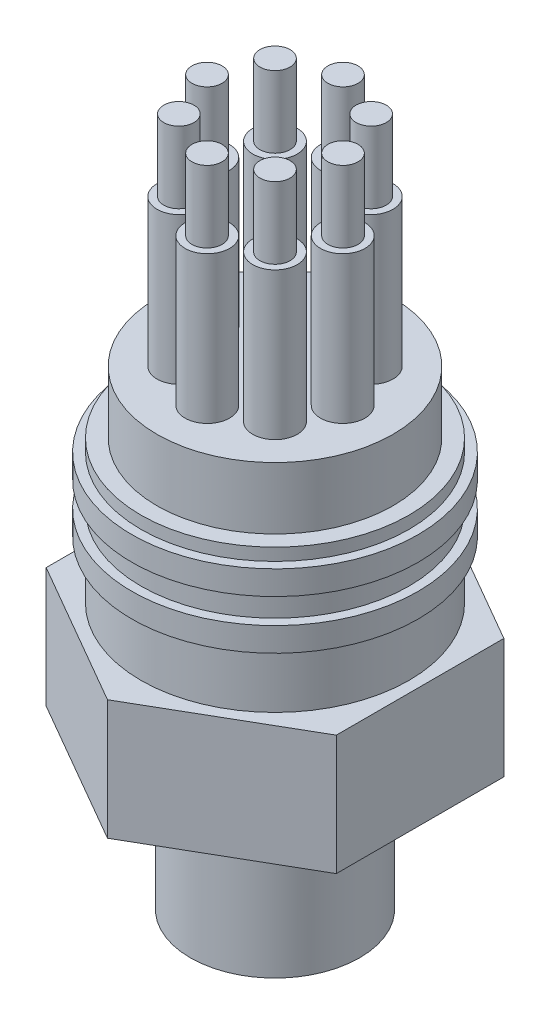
ISO-10303-21;
HEADER;
FILE_DESCRIPTION(('STEP AP214'),'2;1');
FILE_NAME('part.step','',(''),(''),'','','');
FILE_SCHEMA(('AUTOMOTIVE_DESIGN { 1 0 10303 214 1 1 1 1 }'));
ENDSEC;
DATA;
#1=APPLICATION_CONTEXT('core data for automotive mechanical design processes');
#2=APPLICATION_PROTOCOL_DEFINITION('international standard','automotive_design',2000,#1);
#3=PRODUCT_CONTEXT('',#1,'mechanical');
#4=PRODUCT('Part','Part','',(#3));
#5=PRODUCT_RELATED_PRODUCT_CATEGORY('part','',(#4));
#6=PRODUCT_DEFINITION_FORMATION('','',#4);
#7=PRODUCT_DEFINITION_CONTEXT('part definition',#1,'design');
#8=PRODUCT_DEFINITION('design','',#6,#7);
#9=PRODUCT_DEFINITION_SHAPE('','',#8);
#10=(LENGTH_UNIT() NAMED_UNIT(*) SI_UNIT(.MILLI.,.METRE.));
#11=(NAMED_UNIT(*) PLANE_ANGLE_UNIT() SI_UNIT($,.RADIAN.));
#12=(NAMED_UNIT(*) SI_UNIT($,.STERADIAN.) SOLID_ANGLE_UNIT());
#13=UNCERTAINTY_MEASURE_WITH_UNIT(LENGTH_MEASURE(1.E-05),#10,'distance_accuracy_value','');
#14=(GEOMETRIC_REPRESENTATION_CONTEXT(3) GLOBAL_UNCERTAINTY_ASSIGNED_CONTEXT((#13)) GLOBAL_UNIT_ASSIGNED_CONTEXT((#10,
#11,#12)) REPRESENTATION_CONTEXT('',''));
#15=CARTESIAN_POINT('',(0.,0.,0.));
#16=DIRECTION('',(0.,0.,1.));
#17=DIRECTION('',(1.,0.,0.));
#18=AXIS2_PLACEMENT_3D('',#15,#16,#17);
#19=CARTESIAN_POINT('',(0.,-18.280303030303,0.));
#20=DIRECTION('',(0.,1.,0.));
#21=DIRECTION('',(0.,0.,1.));
#22=AXIS2_PLACEMENT_3D('',#19,#20,#21);
#23=CYLINDRICAL_SURFACE('',#22,5.55625);
#24=CARTESIAN_POINT('',(0.,0.,0.));
#25=DIRECTION('',(0.,1.,0.));
#26=DIRECTION('',(0.,0.,1.));
#27=AXIS2_PLACEMENT_3D('',#24,#25,#26);
#28=CIRCLE('',#27,5.55625);
#29=CARTESIAN_POINT('',(0.,0.,5.55625));
#30=VERTEX_POINT('',#29);
#31=EDGE_CURVE('E150',#30,#30,#28,.F.);
#32=ORIENTED_EDGE('',*,*,#31,.T.);
#33=EDGE_LOOP('',(#32));
#34=FACE_BOUND('',#33,.T.);
#35=CARTESIAN_POINT('',(0.,-9.525,0.));
#36=DIRECTION('',(0.,-1.,0.));
#37=DIRECTION('',(0.,0.,-1.));
#38=AXIS2_PLACEMENT_3D('',#35,#36,#37);
#39=CIRCLE('',#38,5.55625);
#40=CARTESIAN_POINT('',(0.,-9.525,-5.55625));
#41=VERTEX_POINT('',#40);
#42=EDGE_CURVE('E40',#41,#41,#39,.T.);
#43=ORIENTED_EDGE('',*,*,#42,.F.);
#44=EDGE_LOOP('',(#43));
#45=FACE_BOUND('',#44,.T.);
#46=ADVANCED_FACE('F36',(#34,#45),#23,.T.);
#47=CARTESIAN_POINT('',(-9.52499999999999,0.,-16.4977839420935));
#48=DIRECTION('',(0.,1.,0.));
#49=DIRECTION('',(0.,0.,1.));
#50=AXIS2_PLACEMENT_3D('',#47,#48,#49);
#51=PLANE('',#50);
#52=DIRECTION('',(-0.866025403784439,0.,-0.5));
#53=VECTOR('',#52,1.);
#54=CARTESIAN_POINT('',(9.52499999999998,0.,-5.4992613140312));
#55=LINE('',#54,#53);
#56=CARTESIAN_POINT('',(9.52499999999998,0.,-5.4992613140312));
#57=VERTEX_POINT('',#56);
#58=CARTESIAN_POINT('',(0.,0.,-10.9985226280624));
#59=VERTEX_POINT('',#58);
#60=EDGE_CURVE('E96',#57,#59,#55,.T.);
#61=ORIENTED_EDGE('',*,*,#60,.F.);
#62=DIRECTION('',(0.,0.,-1.));
#63=VECTOR('',#62,1.);
#64=CARTESIAN_POINT('',(9.52499999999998,0.,5.49926131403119));
#65=LINE('',#64,#63);
#66=CARTESIAN_POINT('',(9.52499999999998,0.,5.49926131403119));
#67=VERTEX_POINT('',#66);
#68=EDGE_CURVE('E126',#67,#57,#65,.T.);
#69=ORIENTED_EDGE('',*,*,#68,.F.);
#70=DIRECTION('',(0.866025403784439,0.,-0.5));
#71=VECTOR('',#70,1.);
#72=CARTESIAN_POINT('',(0.,0.,10.9985226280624));
#73=LINE('',#72,#71);
#74=CARTESIAN_POINT('',(0.,0.,10.9985226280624));
#75=VERTEX_POINT('',#74);
#76=EDGE_CURVE('E124',#75,#67,#73,.T.);
#77=ORIENTED_EDGE('',*,*,#76,.F.);
#78=DIRECTION('',(0.866025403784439,0.,0.5));
#79=VECTOR('',#78,1.);
#80=CARTESIAN_POINT('',(-9.52499999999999,0.,5.49926131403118));
#81=LINE('',#80,#79);
#82=CARTESIAN_POINT('',(-9.52499999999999,0.,5.49926131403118));
#83=VERTEX_POINT('',#82);
#84=EDGE_CURVE('E122',#83,#75,#81,.T.);
#85=ORIENTED_EDGE('',*,*,#84,.F.);
#86=DIRECTION('',(0.,0.,1.));
#87=VECTOR('',#86,1.);
#88=CARTESIAN_POINT('',(-9.52499999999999,0.,-5.49926131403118));
#89=LINE('',#88,#87);
#90=CARTESIAN_POINT('',(-9.52499999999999,0.,-5.49926131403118));
#91=VERTEX_POINT('',#90);
#92=EDGE_CURVE('E98',#91,#83,#89,.T.);
#93=ORIENTED_EDGE('',*,*,#92,.F.);
#94=DIRECTION('',(-0.866025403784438,0.,0.5));
#95=VECTOR('',#94,1.);
#96=CARTESIAN_POINT('',(0.,0.,-10.9985226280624));
#97=LINE('',#96,#95);
#98=EDGE_CURVE('E90',#59,#91,#97,.T.);
#99=ORIENTED_EDGE('',*,*,#98,.F.);
#100=EDGE_LOOP('',(#61,#69,#77,#85,#93,#99));
#101=FACE_BOUND('',#100,.T.);
#102=CARTESIAN_POINT('',(0.,0.,0.));
#103=DIRECTION('',(0.,1.,0.));
#104=DIRECTION('',(0.,0.,1.));
#105=AXIS2_PLACEMENT_3D('',#102,#103,#104);
#106=CIRCLE('',#105,7.94336420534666);
#107=CARTESIAN_POINT('',(0.,0.,7.94336420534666));
#108=VERTEX_POINT('',#107);
#109=EDGE_CURVE('E11',#108,#108,#106,.F.);
#110=ORIENTED_EDGE('',*,*,#109,.F.);
#111=EDGE_LOOP('',(#110));
#112=FACE_BOUND('',#111,.T.);
#113=ADVANCED_FACE('F92',(#101,#112),#51,.F.);
#114=CARTESIAN_POINT('',(-3.14308964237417,30.988,-3.14308964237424));
#115=DIRECTION('',(0.,1.,0.));
#116=DIRECTION('',(-0.707106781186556,0.,0.707106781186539));
#117=AXIS2_PLACEMENT_3D('',#114,#115,#116);
#118=PLANE('',#117);
#119=CARTESIAN_POINT('',(-3.14308964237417,30.988,-3.14308964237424));
#120=DIRECTION('',(0.,1.,0.));
#121=DIRECTION('',(-0.707106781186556,0.,0.707106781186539));
#122=AXIS2_PLACEMENT_3D('',#119,#120,#121);
#123=CIRCLE('',#122,1.4605);
#124=CARTESIAN_POINT('',(-4.17581909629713,30.988,-2.1103601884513));
#125=VERTEX_POINT('',#124);
#126=EDGE_CURVE('E442',#125,#125,#123,.T.);
#127=ORIENTED_EDGE('',*,*,#126,.T.);
#128=EDGE_LOOP('',(#127));
#129=FACE_BOUND('',#128,.T.);
#130=CARTESIAN_POINT('',(-3.15647769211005,30.988,-3.15647769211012));
#131=DIRECTION('',(0.,1.,0.));
#132=DIRECTION('',(-0.707106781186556,0.,0.707106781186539));
#133=AXIS2_PLACEMENT_3D('',#130,#131,#132);
#134=CIRCLE('',#133,0.9906);
#135=CARTESIAN_POINT('',(-3.85693766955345,30.988,-2.45601771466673));
#136=VERTEX_POINT('',#135);
#137=EDGE_CURVE('E487',#136,#136,#134,.T.);
#138=ORIENTED_EDGE('',*,*,#137,.F.);
#139=EDGE_LOOP('',(#138));
#140=FACE_BOUND('',#139,.T.);
#141=ADVANCED_FACE('F176',(#129,#140),#118,.T.);
#142=CARTESIAN_POINT('',(-4.445,30.988,0.));
#143=DIRECTION('',(0.,1.,0.));
#144=DIRECTION('',(0.,0.,1.));
#145=AXIS2_PLACEMENT_3D('',#142,#143,#144);
#146=PLANE('',#145);
#147=CARTESIAN_POINT('',(-4.445,30.988,0.));
#148=DIRECTION('',(0.,1.,0.));
#149=DIRECTION('',(0.,0.,1.));
#150=AXIS2_PLACEMENT_3D('',#147,#148,#149);
#151=CIRCLE('',#150,1.4605);
#152=CARTESIAN_POINT('',(-4.44500000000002,30.988,1.46049999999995));
#153=VERTEX_POINT('',#152);
#154=EDGE_CURVE('E436',#153,#153,#151,.T.);
#155=ORIENTED_EDGE('',*,*,#154,.T.);
#156=EDGE_LOOP('',(#155));
#157=FACE_BOUND('',#156,.T.);
#158=CARTESIAN_POINT('',(-4.46393356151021,30.988,0.));
#159=DIRECTION('',(0.,1.,0.));
#160=DIRECTION('',(0.,0.,1.));
#161=AXIS2_PLACEMENT_3D('',#158,#159,#160);
#162=CIRCLE('',#161,0.9906);
#163=CARTESIAN_POINT('',(-4.46393356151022,30.988,0.990599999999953));
#164=VERTEX_POINT('',#163);
#165=EDGE_CURVE('E481',#164,#164,#162,.T.);
#166=ORIENTED_EDGE('',*,*,#165,.F.);
#167=EDGE_LOOP('',(#166));
#168=FACE_BOUND('',#167,.T.);
#169=ADVANCED_FACE('F242',(#157,#168),#146,.T.);
#170=CARTESIAN_POINT('',(-3.14308964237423,30.988,3.14308964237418));
#171=DIRECTION('',(0.,1.,0.));
#172=DIRECTION('',(0.707106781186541,0.,0.707106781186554));
#173=AXIS2_PLACEMENT_3D('',#170,#171,#172);
#174=PLANE('',#173);
#175=CARTESIAN_POINT('',(-3.14308964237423,30.988,3.14308964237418));
#176=DIRECTION('',(0.,1.,0.));
#177=DIRECTION('',(0.707106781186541,0.,0.707106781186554));
#178=AXIS2_PLACEMENT_3D('',#175,#176,#177);
#179=CIRCLE('',#178,1.4605);
#180=CARTESIAN_POINT('',(-2.11036018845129,30.988,4.17581909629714));
#181=VERTEX_POINT('',#180);
#182=EDGE_CURVE('E430',#181,#181,#179,.T.);
#183=ORIENTED_EDGE('',*,*,#182,.T.);
#184=EDGE_LOOP('',(#183));
#185=FACE_BOUND('',#184,.T.);
#186=CARTESIAN_POINT('',(-3.15647769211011,30.988,3.15647769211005));
#187=DIRECTION('',(0.,1.,0.));
#188=DIRECTION('',(0.707106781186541,0.,0.707106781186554));
#189=AXIS2_PLACEMENT_3D('',#186,#187,#188);
#190=CIRCLE('',#189,0.9906);
#191=CARTESIAN_POINT('',(-2.45601771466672,30.988,3.85693766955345));
#192=VERTEX_POINT('',#191);
#193=EDGE_CURVE('E475',#192,#192,#190,.T.);
#194=ORIENTED_EDGE('',*,*,#193,.F.);
#195=EDGE_LOOP('',(#194));
#196=FACE_BOUND('',#195,.T.);
#197=ADVANCED_FACE('F250',(#185,#196),#174,.T.);
#198=CARTESIAN_POINT('',(0.,30.988,4.445));
#199=DIRECTION('',(0.,1.,0.));
#200=DIRECTION('',(1.,0.,0.));
#201=AXIS2_PLACEMENT_3D('',#198,#199,#200);
#202=PLANE('',#201);
#203=CARTESIAN_POINT('',(0.,30.988,4.445));
#204=DIRECTION('',(0.,1.,0.));
#205=DIRECTION('',(1.,0.,0.));
#206=AXIS2_PLACEMENT_3D('',#203,#204,#205);
#207=CIRCLE('',#206,1.4605);
#208=CARTESIAN_POINT('',(1.46049999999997,30.988,4.44500000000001));
#209=VERTEX_POINT('',#208);
#210=EDGE_CURVE('E424',#209,#209,#207,.T.);
#211=ORIENTED_EDGE('',*,*,#210,.T.);
#212=EDGE_LOOP('',(#211));
#213=FACE_BOUND('',#212,.T.);
#214=CARTESIAN_POINT('',(0.,30.988,4.4639335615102));
#215=DIRECTION('',(0.,1.,0.));
#216=DIRECTION('',(1.,0.,0.));
#217=AXIS2_PLACEMENT_3D('',#214,#215,#216);
#218=CIRCLE('',#217,0.9906);
#219=CARTESIAN_POINT('',(0.990599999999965,30.988,4.46393356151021));
#220=VERTEX_POINT('',#219);
#221=EDGE_CURVE('E469',#220,#220,#218,.T.);
#222=ORIENTED_EDGE('',*,*,#221,.F.);
#223=EDGE_LOOP('',(#222));
#224=FACE_BOUND('',#223,.T.);
#225=ADVANCED_FACE('F258',(#213,#224),#202,.T.);
#226=CARTESIAN_POINT('',(3.14308964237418,30.988,3.14308964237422));
#227=DIRECTION('',(0.,1.,0.));
#228=DIRECTION('',(0.707106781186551,0.,-0.707106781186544));
#229=AXIS2_PLACEMENT_3D('',#226,#227,#228);
#230=PLANE('',#229);
#231=CARTESIAN_POINT('',(3.14308964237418,30.988,3.14308964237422));
#232=DIRECTION('',(0.,1.,0.));
#233=DIRECTION('',(0.707106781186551,0.,-0.707106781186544));
#234=AXIS2_PLACEMENT_3D('',#231,#232,#233);
#235=CIRCLE('',#234,1.4605);
#236=CARTESIAN_POINT('',(4.17581909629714,30.988,2.11036018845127));
#237=VERTEX_POINT('',#236);
#238=EDGE_CURVE('E418',#237,#237,#235,.T.);
#239=ORIENTED_EDGE('',*,*,#238,.T.);
#240=EDGE_LOOP('',(#239));
#241=FACE_BOUND('',#240,.T.);
#242=CARTESIAN_POINT('',(3.15647769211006,30.988,3.1564776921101));
#243=DIRECTION('',(0.,1.,0.));
#244=DIRECTION('',(0.707106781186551,0.,-0.707106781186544));
#245=AXIS2_PLACEMENT_3D('',#242,#243,#244);
#246=CIRCLE('',#245,0.9906);
#247=CARTESIAN_POINT('',(3.85693766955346,30.988,2.45601771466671));
#248=VERTEX_POINT('',#247);
#249=EDGE_CURVE('E463',#248,#248,#246,.T.);
#250=ORIENTED_EDGE('',*,*,#249,.F.);
#251=EDGE_LOOP('',(#250));
#252=FACE_BOUND('',#251,.T.);
#253=ADVANCED_FACE('F266',(#241,#252),#230,.T.);
#254=CARTESIAN_POINT('',(4.445,30.988,0.));
#255=DIRECTION('',(0.,1.,0.));
#256=DIRECTION('',(0.,0.,-1.));
#257=AXIS2_PLACEMENT_3D('',#254,#255,#256);
#258=PLANE('',#257);
#259=CARTESIAN_POINT('',(4.445,30.988,0.));
#260=DIRECTION('',(0.,1.,0.));
#261=DIRECTION('',(0.,0.,-1.));
#262=AXIS2_PLACEMENT_3D('',#259,#260,#261);
#263=CIRCLE('',#262,1.4605);
#264=CARTESIAN_POINT('',(4.445,30.988,-1.46049999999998));
#265=VERTEX_POINT('',#264);
#266=EDGE_CURVE('E412',#265,#265,#263,.T.);
#267=ORIENTED_EDGE('',*,*,#266,.T.);
#268=EDGE_LOOP('',(#267));
#269=FACE_BOUND('',#268,.T.);
#270=CARTESIAN_POINT('',(4.4639335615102,30.988,0.));
#271=DIRECTION('',(0.,1.,0.));
#272=DIRECTION('',(0.,0.,-1.));
#273=AXIS2_PLACEMENT_3D('',#270,#271,#272);
#274=CIRCLE('',#273,0.9906);
#275=CARTESIAN_POINT('',(4.4639335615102,30.988,-0.990599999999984));
#276=VERTEX_POINT('',#275);
#277=EDGE_CURVE('E457',#276,#276,#274,.T.);
#278=ORIENTED_EDGE('',*,*,#277,.F.);
#279=EDGE_LOOP('',(#278));
#280=FACE_BOUND('',#279,.T.);
#281=ADVANCED_FACE('F274',(#269,#280),#258,.T.);
#282=CARTESIAN_POINT('',(3.14308964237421,30.988,-3.1430896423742));
#283=DIRECTION('',(0.,1.,0.));
#284=DIRECTION('',(-0.707106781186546,0.,-0.707106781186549));
#285=AXIS2_PLACEMENT_3D('',#282,#283,#284);
#286=PLANE('',#285);
#287=CARTESIAN_POINT('',(3.14308964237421,30.988,-3.1430896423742));
#288=DIRECTION('',(0.,1.,0.));
#289=DIRECTION('',(-0.707106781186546,0.,-0.707106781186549));
#290=AXIS2_PLACEMENT_3D('',#287,#288,#289);
#291=CIRCLE('',#290,1.4605);
#292=CARTESIAN_POINT('',(2.11036018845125,30.988,-4.17581909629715));
#293=VERTEX_POINT('',#292);
#294=EDGE_CURVE('E408',#293,#293,#291,.T.);
#295=ORIENTED_EDGE('',*,*,#294,.T.);
#296=EDGE_LOOP('',(#295));
#297=FACE_BOUND('',#296,.T.);
#298=CARTESIAN_POINT('',(3.15647769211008,30.988,-3.15647769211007));
#299=DIRECTION('',(0.,1.,0.));
#300=DIRECTION('',(-0.707106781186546,0.,-0.707106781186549));
#301=AXIS2_PLACEMENT_3D('',#298,#299,#300);
#302=CIRCLE('',#301,0.9906);
#303=CARTESIAN_POINT('',(2.45601771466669,30.988,-3.85693766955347));
#304=VERTEX_POINT('',#303);
#305=EDGE_CURVE('E451',#304,#304,#302,.T.);
#306=ORIENTED_EDGE('',*,*,#305,.F.);
#307=EDGE_LOOP('',(#306));
#308=FACE_BOUND('',#307,.T.);
#309=ADVANCED_FACE('F282',(#297,#308),#286,.T.);
#310=CARTESIAN_POINT('',(0.,21.336,0.));
#311=DIRECTION('',(0.,1.,0.));
#312=DIRECTION('',(-1.,0.,0.));
#313=AXIS2_PLACEMENT_3D('',#310,#311,#312);
#314=PLANE('',#313);
#315=CARTESIAN_POINT('',(-4.445,21.336,0.));
#316=DIRECTION('',(0.,1.,0.));
#317=DIRECTION('',(0.,0.,1.));
#318=AXIS2_PLACEMENT_3D('',#315,#316,#317);
#319=CIRCLE('',#318,1.4605);
#320=CARTESIAN_POINT('',(-4.44500000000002,21.336,1.46049999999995));
#321=VERTEX_POINT('',#320);
#322=EDGE_CURVE('E439',#321,#321,#319,.T.);
#323=ORIENTED_EDGE('',*,*,#322,.F.);
#324=EDGE_LOOP('',(#323));
#325=FACE_BOUND('',#324,.T.);
#326=CARTESIAN_POINT('',(0.,21.336,4.445));
#327=DIRECTION('',(0.,1.,0.));
#328=DIRECTION('',(1.,0.,0.));
#329=AXIS2_PLACEMENT_3D('',#326,#327,#328);
#330=CIRCLE('',#329,1.4605);
#331=CARTESIAN_POINT('',(1.46049999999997,21.336,4.44500000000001));
#332=VERTEX_POINT('',#331);
#333=EDGE_CURVE('E427',#332,#332,#330,.T.);
#334=ORIENTED_EDGE('',*,*,#333,.F.);
#335=EDGE_LOOP('',(#334));
#336=FACE_BOUND('',#335,.T.);
#337=CARTESIAN_POINT('',(4.445,21.336,0.));
#338=DIRECTION('',(0.,1.,0.));
#339=DIRECTION('',(0.,0.,-1.));
#340=AXIS2_PLACEMENT_3D('',#337,#338,#339);
#341=CIRCLE('',#340,1.4605);
#342=CARTESIAN_POINT('',(4.445,21.336,-1.46049999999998));
#343=VERTEX_POINT('',#342);
#344=EDGE_CURVE('E415',#343,#343,#341,.T.);
#345=ORIENTED_EDGE('',*,*,#344,.F.);
#346=EDGE_LOOP('',(#345));
#347=FACE_BOUND('',#346,.T.);
#348=CARTESIAN_POINT('',(0.,21.336,-4.445));
#349=DIRECTION('',(0.,1.,0.));
#350=DIRECTION('',(-1.,0.,0.));
#351=AXIS2_PLACEMENT_3D('',#348,#349,#350);
#352=CIRCLE('',#351,1.4605);
#353=CARTESIAN_POINT('',(-1.4605,21.336,-4.445));
#354=VERTEX_POINT('',#353);
#355=EDGE_CURVE('E399',#354,#354,#352,.T.);
#356=ORIENTED_EDGE('',*,*,#355,.F.);
#357=EDGE_LOOP('',(#356));
#358=FACE_BOUND('',#357,.T.);
#359=CARTESIAN_POINT('',(0.,21.336,0.));
#360=DIRECTION('',(0.,1.,0.));
#361=DIRECTION('',(-1.,0.,0.));
#362=AXIS2_PLACEMENT_3D('',#359,#360,#361);
#363=CIRCLE('',#362,7.747);
#364=CARTESIAN_POINT('',(-7.747,21.336,0.));
#365=VERTEX_POINT('',#364);
#366=EDGE_CURVE('E393',#365,#365,#363,.T.);
#367=ORIENTED_EDGE('',*,*,#366,.T.);
#368=EDGE_LOOP('',(#367));
#369=FACE_BOUND('',#368,.T.);
#370=CARTESIAN_POINT('',(3.14308964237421,21.336,-3.1430896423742));
#371=DIRECTION('',(0.,1.,0.));
#372=DIRECTION('',(-0.707106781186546,0.,-0.707106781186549));
#373=AXIS2_PLACEMENT_3D('',#370,#371,#372);
#374=CIRCLE('',#373,1.4605);
#375=CARTESIAN_POINT('',(2.11036018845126,21.336,-4.17581909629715));
#376=VERTEX_POINT('',#375);
#377=EDGE_CURVE('E409',#376,#376,#374,.T.);
#378=ORIENTED_EDGE('',*,*,#377,.F.);
#379=EDGE_LOOP('',(#378));
#380=FACE_BOUND('',#379,.T.);
#381=CARTESIAN_POINT('',(3.14308964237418,21.336,3.14308964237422));
#382=DIRECTION('',(0.,1.,0.));
#383=DIRECTION('',(0.707106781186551,0.,-0.707106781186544));
#384=AXIS2_PLACEMENT_3D('',#381,#382,#383);
#385=CIRCLE('',#384,1.4605);
#386=CARTESIAN_POINT('',(4.17581909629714,21.336,2.11036018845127));
#387=VERTEX_POINT('',#386);
#388=EDGE_CURVE('E421',#387,#387,#385,.T.);
#389=ORIENTED_EDGE('',*,*,#388,.F.);
#390=EDGE_LOOP('',(#389));
#391=FACE_BOUND('',#390,.T.);
#392=CARTESIAN_POINT('',(-3.14308964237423,21.336,3.14308964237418));
#393=DIRECTION('',(0.,1.,0.));
#394=DIRECTION('',(0.707106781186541,0.,0.707106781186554));
#395=AXIS2_PLACEMENT_3D('',#392,#393,#394);
#396=CIRCLE('',#395,1.4605);
#397=CARTESIAN_POINT('',(-2.11036018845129,21.336,4.17581909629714));
#398=VERTEX_POINT('',#397);
#399=EDGE_CURVE('E433',#398,#398,#396,.T.);
#400=ORIENTED_EDGE('',*,*,#399,.F.);
#401=EDGE_LOOP('',(#400));
#402=FACE_BOUND('',#401,.T.);
#403=CARTESIAN_POINT('',(-3.14308964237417,21.336,-3.14308964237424));
#404=DIRECTION('',(0.,1.,0.));
#405=DIRECTION('',(-0.707106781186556,0.,0.707106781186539));
#406=AXIS2_PLACEMENT_3D('',#403,#404,#405);
#407=CIRCLE('',#406,1.4605);
#408=CARTESIAN_POINT('',(-4.17581909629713,21.336,-2.1103601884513));
#409=VERTEX_POINT('',#408);
#410=EDGE_CURVE('E445',#409,#409,#407,.T.);
#411=ORIENTED_EDGE('',*,*,#410,.F.);
#412=EDGE_LOOP('',(#411));
#413=FACE_BOUND('',#412,.T.);
#414=ADVANCED_FACE('F290',(#325,#336,#347,#358,#369,#380,#391,#402,#413),#314,.T.);
#415=CARTESIAN_POINT('',(0.,30.988,-4.445));
#416=DIRECTION('',(0.,1.,0.));
#417=DIRECTION('',(-1.,0.,0.));
#418=AXIS2_PLACEMENT_3D('',#415,#416,#417);
#419=PLANE('',#418);
#420=CARTESIAN_POINT('',(0.,30.988,-4.445));
#421=DIRECTION('',(0.,1.,0.));
#422=DIRECTION('',(-1.,0.,0.));
#423=AXIS2_PLACEMENT_3D('',#420,#421,#422);
#424=CIRCLE('',#423,1.4605);
#425=CARTESIAN_POINT('',(-1.4605,30.988,-4.445));
#426=VERTEX_POINT('',#425);
#427=EDGE_CURVE('E396',#426,#426,#424,.T.);
#428=ORIENTED_EDGE('',*,*,#427,.T.);
#429=EDGE_LOOP('',(#428));
#430=FACE_BOUND('',#429,.T.);
#431=CARTESIAN_POINT('',(0.,30.988,-4.4639335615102));
#432=DIRECTION('',(0.,1.,0.));
#433=DIRECTION('',(-1.,0.,0.));
#434=AXIS2_PLACEMENT_3D('',#431,#432,#433);
#435=CIRCLE('',#434,0.9906);
#436=CARTESIAN_POINT('',(-0.990600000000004,30.988,-4.4639335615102));
#437=VERTEX_POINT('',#436);
#438=EDGE_CURVE('E405',#437,#437,#435,.T.);
#439=ORIENTED_EDGE('',*,*,#438,.F.);
#440=EDGE_LOOP('',(#439));
#441=FACE_BOUND('',#440,.T.);
#442=ADVANCED_FACE('F304',(#430,#441),#419,.T.);
#443=CARTESIAN_POINT('',(8.8011,17.272,0.));
#444=DIRECTION('',(0.,-1.,0.));
#445=DIRECTION('',(1.,0.,0.));
#446=AXIS2_PLACEMENT_3D('',#443,#444,#445);
#447=PLANE('',#446);
#448=CARTESIAN_POINT('',(0.,17.272,0.));
#449=DIRECTION('',(0.,1.,0.));
#450=DIRECTION('',(-1.,0.,0.));
#451=AXIS2_PLACEMENT_3D('',#448,#449,#450);
#452=CIRCLE('',#451,8.8011);
#453=CARTESIAN_POINT('',(-8.8011,17.272,0.));
#454=VERTEX_POINT('',#453);
#455=EDGE_CURVE('E114',#454,#454,#452,.T.);
#456=ORIENTED_EDGE('',*,*,#455,.T.);
#457=EDGE_LOOP('',(#456));
#458=FACE_BOUND('',#457,.T.);
#459=CARTESIAN_POINT('',(0.,17.272,0.));
#460=DIRECTION('',(0.,-1.,0.));
#461=DIRECTION('',(1.,0.,0.));
#462=AXIS2_PLACEMENT_3D('',#459,#460,#461);
#463=CIRCLE('',#462,7.747);
#464=CARTESIAN_POINT('',(7.747,17.272,0.));
#465=VERTEX_POINT('',#464);
#466=EDGE_CURVE('E109',#465,#465,#463,.F.);
#467=ORIENTED_EDGE('',*,*,#466,.F.);
#468=EDGE_LOOP('',(#467));
#469=FACE_BOUND('',#468,.T.);
#470=ADVANCED_FACE('F307',(#458,#469),#447,.F.);
#471=CARTESIAN_POINT('',(-9.52499999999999,7.874,-16.4977839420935));
#472=DIRECTION('',(0.,1.,0.));
#473=DIRECTION('',(0.,0.,1.));
#474=AXIS2_PLACEMENT_3D('',#471,#472,#473);
#475=PLANE('',#474);
#476=DIRECTION('',(-0.866025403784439,0.,-0.5));
#477=VECTOR('',#476,1.);
#478=CARTESIAN_POINT('',(9.52499999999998,7.874,-5.4992613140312));
#479=LINE('',#478,#477);
#480=CARTESIAN_POINT('',(9.52499999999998,7.874,-5.4992613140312));
#481=VERTEX_POINT('',#480);
#482=CARTESIAN_POINT('',(0.,7.874,-10.9985226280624));
#483=VERTEX_POINT('',#482);
#484=EDGE_CURVE('E128',#481,#483,#479,.T.);
#485=ORIENTED_EDGE('',*,*,#484,.T.);
#486=DIRECTION('',(-0.866025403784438,0.,0.5));
#487=VECTOR('',#486,1.);
#488=CARTESIAN_POINT('',(0.,7.874,-10.9985226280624));
#489=LINE('',#488,#487);
#490=CARTESIAN_POINT('',(-9.52499999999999,7.874,-5.49926131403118));
#491=VERTEX_POINT('',#490);
#492=EDGE_CURVE('E106',#483,#491,#489,.T.);
#493=ORIENTED_EDGE('',*,*,#492,.T.);
#494=DIRECTION('',(0.,0.,1.));
#495=VECTOR('',#494,1.);
#496=CARTESIAN_POINT('',(-9.52499999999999,7.874,-5.49926131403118));
#497=LINE('',#496,#495);
#498=CARTESIAN_POINT('',(-9.52499999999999,7.874,5.49926131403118));
#499=VERTEX_POINT('',#498);
#500=EDGE_CURVE('E131',#491,#499,#497,.T.);
#501=ORIENTED_EDGE('',*,*,#500,.T.);
#502=DIRECTION('',(0.866025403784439,0.,0.5));
#503=VECTOR('',#502,1.);
#504=CARTESIAN_POINT('',(-9.52499999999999,7.874,5.49926131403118));
#505=LINE('',#504,#503);
#506=CARTESIAN_POINT('',(0.,7.874,10.9985226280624));
#507=VERTEX_POINT('',#506);
#508=EDGE_CURVE('E133',#499,#507,#505,.T.);
#509=ORIENTED_EDGE('',*,*,#508,.T.);
#510=DIRECTION('',(0.866025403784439,0.,-0.5));
#511=VECTOR('',#510,1.);
#512=CARTESIAN_POINT('',(0.,7.874,10.9985226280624));
#513=LINE('',#512,#511);
#514=CARTESIAN_POINT('',(9.52499999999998,7.874,5.49926131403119));
#515=VERTEX_POINT('',#514);
#516=EDGE_CURVE('E57',#507,#515,#513,.T.);
#517=ORIENTED_EDGE('',*,*,#516,.T.);
#518=DIRECTION('',(0.,0.,-1.));
#519=VECTOR('',#518,1.);
#520=CARTESIAN_POINT('',(9.52499999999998,7.874,5.49926131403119));
#521=LINE('',#520,#519);
#522=EDGE_CURVE('E52',#515,#481,#521,.T.);
#523=ORIENTED_EDGE('',*,*,#522,.T.);
#524=EDGE_LOOP('',(#485,#493,#501,#509,#517,#523));
#525=FACE_BOUND('',#524,.T.);
#526=CARTESIAN_POINT('',(0.,7.874,0.));
#527=DIRECTION('',(0.,1.,0.));
#528=DIRECTION('',(-1.,0.,0.));
#529=AXIS2_PLACEMENT_3D('',#526,#527,#528);
#530=CIRCLE('',#529,8.8011);
#531=CARTESIAN_POINT('',(-8.8011,7.874,0.));
#532=VERTEX_POINT('',#531);
#533=EDGE_CURVE('E390',#532,#532,#530,.T.);
#534=ORIENTED_EDGE('',*,*,#533,.F.);
#535=EDGE_LOOP('',(#534));
#536=FACE_BOUND('',#535,.T.);
#537=ADVANCED_FACE('F356',(#525,#536),#475,.T.);
#538=CARTESIAN_POINT('',(9.52499999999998,7.874,-5.4992613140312));
#539=DIRECTION('',(-0.5,0.,0.866025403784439));
#540=DIRECTION('',(0.866025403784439,0.,0.5));
#541=AXIS2_PLACEMENT_3D('',#538,#539,#540);
#542=PLANE('',#541);
#543=ORIENTED_EDGE('',*,*,#60,.T.);
#544=DIRECTION('',(0.,-1.,0.));
#545=VECTOR('',#544,1.);
#546=CARTESIAN_POINT('',(0.,7.874,-10.9985226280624));
#547=LINE('',#546,#545);
#548=EDGE_CURVE('E104',#483,#59,#547,.T.);
#549=ORIENTED_EDGE('',*,*,#548,.F.);
#550=ORIENTED_EDGE('',*,*,#484,.F.);
#551=DIRECTION('',(0.,-1.,0.));
#552=VECTOR('',#551,1.);
#553=CARTESIAN_POINT('',(9.52499999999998,7.874,-5.4992613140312));
#554=LINE('',#553,#552);
#555=EDGE_CURVE('E113',#481,#57,#554,.T.);
#556=ORIENTED_EDGE('',*,*,#555,.T.);
#557=EDGE_LOOP('',(#543,#549,#550,#556));
#558=FACE_BOUND('',#557,.T.);
#559=ADVANCED_FACE('F38',(#558),#542,.F.);
#560=CARTESIAN_POINT('',(0.,7.874,-10.9985226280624));
#561=DIRECTION('',(0.5,0.,0.866025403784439));
#562=DIRECTION('',(0.866025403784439,0.,-0.5));
#563=AXIS2_PLACEMENT_3D('',#560,#561,#562);
#564=PLANE('',#563);
#565=ORIENTED_EDGE('',*,*,#98,.T.);
#566=DIRECTION('',(0.,-1.,0.));
#567=VECTOR('',#566,1.);
#568=CARTESIAN_POINT('',(-9.52499999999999,7.874,-5.49926131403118));
#569=LINE('',#568,#567);
#570=EDGE_CURVE('E110',#491,#91,#569,.T.);
#571=ORIENTED_EDGE('',*,*,#570,.F.);
#572=ORIENTED_EDGE('',*,*,#492,.F.);
#573=ORIENTED_EDGE('',*,*,#548,.T.);
#574=EDGE_LOOP('',(#565,#571,#572,#573));
#575=FACE_BOUND('',#574,.T.);
#576=ADVANCED_FACE('F105',(#575),#564,.F.);
#577=CARTESIAN_POINT('',(-9.52499999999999,7.874,-5.49926131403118));
#578=DIRECTION('',(1.,0.,0.));
#579=DIRECTION('',(0.,0.,-1.));
#580=AXIS2_PLACEMENT_3D('',#577,#578,#579);
#581=PLANE('',#580);
#582=ORIENTED_EDGE('',*,*,#92,.T.);
#583=DIRECTION('',(0.,-1.,0.));
#584=VECTOR('',#583,1.);
#585=CARTESIAN_POINT('',(-9.52499999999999,7.874,5.49926131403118));
#586=LINE('',#585,#584);
#587=EDGE_CURVE('E144',#499,#83,#586,.T.);
#588=ORIENTED_EDGE('',*,*,#587,.F.);
#589=ORIENTED_EDGE('',*,*,#500,.F.);
#590=ORIENTED_EDGE('',*,*,#570,.T.);
#591=EDGE_LOOP('',(#582,#588,#589,#590));
#592=FACE_BOUND('',#591,.T.);
#593=ADVANCED_FACE('F589',(#592),#581,.F.);
#594=CARTESIAN_POINT('',(-9.52499999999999,7.874,5.49926131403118));
#595=DIRECTION('',(0.5,0.,-0.866025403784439));
#596=DIRECTION('',(-0.866025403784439,0.,-0.5));
#597=AXIS2_PLACEMENT_3D('',#594,#595,#596);
#598=PLANE('',#597);
#599=ORIENTED_EDGE('',*,*,#84,.T.);
#600=DIRECTION('',(0.,-1.,0.));
#601=VECTOR('',#600,1.);
#602=CARTESIAN_POINT('',(0.,7.874,10.9985226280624));
#603=LINE('',#602,#601);
#604=EDGE_CURVE('E141',#507,#75,#603,.T.);
#605=ORIENTED_EDGE('',*,*,#604,.F.);
#606=ORIENTED_EDGE('',*,*,#508,.F.);
#607=ORIENTED_EDGE('',*,*,#587,.T.);
#608=EDGE_LOOP('',(#599,#605,#606,#607));
#609=FACE_BOUND('',#608,.T.);
#610=ADVANCED_FACE('F585',(#609),#598,.F.);
#611=CARTESIAN_POINT('',(0.,7.874,10.9985226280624));
#612=DIRECTION('',(-0.5,0.,-0.866025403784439));
#613=DIRECTION('',(-0.866025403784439,0.,0.5));
#614=AXIS2_PLACEMENT_3D('',#611,#612,#613);
#615=PLANE('',#614);
#616=ORIENTED_EDGE('',*,*,#76,.T.);
#617=DIRECTION('',(0.,-1.,0.));
#618=VECTOR('',#617,1.);
#619=CARTESIAN_POINT('',(9.52499999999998,7.874,5.49926131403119));
#620=LINE('',#619,#618);
#621=EDGE_CURVE('E138',#515,#67,#620,.T.);
#622=ORIENTED_EDGE('',*,*,#621,.F.);
#623=ORIENTED_EDGE('',*,*,#516,.F.);
#624=ORIENTED_EDGE('',*,*,#604,.T.);
#625=EDGE_LOOP('',(#616,#622,#623,#624));
#626=FACE_BOUND('',#625,.T.);
#627=ADVANCED_FACE('F581',(#626),#615,.F.);
#628=CARTESIAN_POINT('',(9.52499999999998,7.874,5.49926131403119));
#629=DIRECTION('',(-1.,0.,0.));
#630=DIRECTION('',(0.,0.,1.));
#631=AXIS2_PLACEMENT_3D('',#628,#629,#630);
#632=PLANE('',#631);
#633=ORIENTED_EDGE('',*,*,#68,.T.);
#634=ORIENTED_EDGE('',*,*,#555,.F.);
#635=ORIENTED_EDGE('',*,*,#522,.F.);
#636=ORIENTED_EDGE('',*,*,#621,.T.);
#637=EDGE_LOOP('',(#633,#634,#635,#636));
#638=FACE_BOUND('',#637,.T.);
#639=ADVANCED_FACE('F353',(#638),#632,.F.);
#640=CARTESIAN_POINT('',(0.,0.,0.));
#641=DIRECTION('',(0.,1.,0.));
#642=DIRECTION('',(-1.,0.,0.));
#643=AXIS2_PLACEMENT_3D('',#640,#641,#642);
#644=CYLINDRICAL_SURFACE('',#643,8.8011);
#645=ORIENTED_EDGE('',*,*,#455,.F.);
#646=EDGE_LOOP('',(#645));
#647=FACE_BOUND('',#646,.T.);
#648=CARTESIAN_POINT('',(0.,16.4592,0.));
#649=DIRECTION('',(0.,1.,0.));
#650=DIRECTION('',(-1.,0.,0.));
#651=AXIS2_PLACEMENT_3D('',#648,#649,#650);
#652=CIRCLE('',#651,8.8011);
#653=CARTESIAN_POINT('',(-8.8011,16.4592,0.));
#654=VERTEX_POINT('',#653);
#655=EDGE_CURVE('E117',#654,#654,#652,.T.);
#656=ORIENTED_EDGE('',*,*,#655,.T.);
#657=EDGE_LOOP('',(#656));
#658=FACE_BOUND('',#657,.T.);
#659=ADVANCED_FACE('F350',(#647,#658),#644,.T.);
#660=CARTESIAN_POINT('',(9.398,16.4592,0.));
#661=DIRECTION('',(0.,-1.,0.));
#662=DIRECTION('',(1.,0.,0.));
#663=AXIS2_PLACEMENT_3D('',#660,#661,#662);
#664=PLANE('',#663);
#665=ORIENTED_EDGE('',*,*,#655,.F.);
#666=EDGE_LOOP('',(#665));
#667=FACE_BOUND('',#666,.T.);
#668=CARTESIAN_POINT('',(0.,16.4592,0.));
#669=DIRECTION('',(0.,1.,0.));
#670=DIRECTION('',(-1.,0.,0.));
#671=AXIS2_PLACEMENT_3D('',#668,#669,#670);
#672=CIRCLE('',#671,9.398);
#673=CARTESIAN_POINT('',(-9.398,16.4592,0.));
#674=VERTEX_POINT('',#673);
#675=EDGE_CURVE('E368',#674,#674,#672,.T.);
#676=ORIENTED_EDGE('',*,*,#675,.T.);
#677=EDGE_LOOP('',(#676));
#678=FACE_BOUND('',#677,.T.);
#679=ADVANCED_FACE('F346',(#667,#678),#664,.F.);
#680=CARTESIAN_POINT('',(0.,0.,0.));
#681=DIRECTION('',(0.,1.,0.));
#682=DIRECTION('',(-1.,0.,0.));
#683=AXIS2_PLACEMENT_3D('',#680,#681,#682);
#684=CYLINDRICAL_SURFACE('',#683,9.398);
#685=ORIENTED_EDGE('',*,*,#675,.F.);
#686=EDGE_LOOP('',(#685));
#687=FACE_BOUND('',#686,.T.);
#688=CARTESIAN_POINT('',(0.,14.8844,0.));
#689=DIRECTION('',(0.,1.,0.));
#690=DIRECTION('',(-1.,0.,0.));
#691=AXIS2_PLACEMENT_3D('',#688,#689,#690);
#692=CIRCLE('',#691,9.398);
#693=CARTESIAN_POINT('',(-9.398,14.8844,0.));
#694=VERTEX_POINT('',#693);
#695=EDGE_CURVE('E370',#694,#694,#692,.T.);
#696=ORIENTED_EDGE('',*,*,#695,.T.);
#697=EDGE_LOOP('',(#696));
#698=FACE_BOUND('',#697,.T.);
#699=ADVANCED_FACE('F342',(#687,#698),#684,.T.);
#700=CARTESIAN_POINT('',(8.8011,14.8844,0.));
#701=DIRECTION('',(0.,1.,0.));
#702=DIRECTION('',(-1.,0.,0.));
#703=AXIS2_PLACEMENT_3D('',#700,#701,#702);
#704=PLANE('',#703);
#705=ORIENTED_EDGE('',*,*,#695,.F.);
#706=EDGE_LOOP('',(#705));
#707=FACE_BOUND('',#706,.T.);
#708=CARTESIAN_POINT('',(0.,14.8844,0.));
#709=DIRECTION('',(0.,1.,0.));
#710=DIRECTION('',(-1.,0.,0.));
#711=AXIS2_PLACEMENT_3D('',#708,#709,#710);
#712=CIRCLE('',#711,8.8011);
#713=CARTESIAN_POINT('',(-8.8011,14.8844,0.));
#714=VERTEX_POINT('',#713);
#715=EDGE_CURVE('E375',#714,#714,#712,.T.);
#716=ORIENTED_EDGE('',*,*,#715,.T.);
#717=EDGE_LOOP('',(#716));
#718=FACE_BOUND('',#717,.T.);
#719=ADVANCED_FACE('F338',(#707,#718),#704,.F.);
#720=CARTESIAN_POINT('',(0.,0.,0.));
#721=DIRECTION('',(0.,1.,0.));
#722=DIRECTION('',(-1.,0.,0.));
#723=AXIS2_PLACEMENT_3D('',#720,#721,#722);
#724=CYLINDRICAL_SURFACE('',#723,8.8011);
#725=ORIENTED_EDGE('',*,*,#715,.F.);
#726=EDGE_LOOP('',(#725));
#727=FACE_BOUND('',#726,.T.);
#728=CARTESIAN_POINT('',(0.,13.2334,0.));
#729=DIRECTION('',(0.,1.,0.));
#730=DIRECTION('',(-1.,0.,0.));
#731=AXIS2_PLACEMENT_3D('',#728,#729,#730);
#732=CIRCLE('',#731,8.8011);
#733=CARTESIAN_POINT('',(-8.8011,13.2334,0.));
#734=VERTEX_POINT('',#733);
#735=EDGE_CURVE('E378',#734,#734,#732,.T.);
#736=ORIENTED_EDGE('',*,*,#735,.T.);
#737=EDGE_LOOP('',(#736));
#738=FACE_BOUND('',#737,.T.);
#739=ADVANCED_FACE('F334',(#727,#738),#724,.T.);
#740=CARTESIAN_POINT('',(9.398,13.2334,0.));
#741=DIRECTION('',(0.,-1.,0.));
#742=DIRECTION('',(1.,0.,0.));
#743=AXIS2_PLACEMENT_3D('',#740,#741,#742);
#744=PLANE('',#743);
#745=ORIENTED_EDGE('',*,*,#735,.F.);
#746=EDGE_LOOP('',(#745));
#747=FACE_BOUND('',#746,.T.);
#748=CARTESIAN_POINT('',(0.,13.2334,0.));
#749=DIRECTION('',(0.,1.,0.));
#750=DIRECTION('',(-1.,0.,0.));
#751=AXIS2_PLACEMENT_3D('',#748,#749,#750);
#752=CIRCLE('',#751,9.398);
#753=CARTESIAN_POINT('',(-9.398,13.2334,0.));
#754=VERTEX_POINT('',#753);
#755=EDGE_CURVE('E381',#754,#754,#752,.T.);
#756=ORIENTED_EDGE('',*,*,#755,.T.);
#757=EDGE_LOOP('',(#756));
#758=FACE_BOUND('',#757,.T.);
#759=ADVANCED_FACE('F330',(#747,#758),#744,.F.);
#760=CARTESIAN_POINT('',(0.,0.,0.));
#761=DIRECTION('',(0.,1.,0.));
#762=DIRECTION('',(-1.,0.,0.));
#763=AXIS2_PLACEMENT_3D('',#760,#761,#762);
#764=CYLINDRICAL_SURFACE('',#763,9.398);
#765=ORIENTED_EDGE('',*,*,#755,.F.);
#766=EDGE_LOOP('',(#765));
#767=FACE_BOUND('',#766,.T.);
#768=CARTESIAN_POINT('',(0.,11.6586,0.));
#769=DIRECTION('',(0.,1.,0.));
#770=DIRECTION('',(-1.,0.,0.));
#771=AXIS2_PLACEMENT_3D('',#768,#769,#770);
#772=CIRCLE('',#771,9.398);
#773=CARTESIAN_POINT('',(-9.398,11.6586,0.));
#774=VERTEX_POINT('',#773);
#775=EDGE_CURVE('E384',#774,#774,#772,.T.);
#776=ORIENTED_EDGE('',*,*,#775,.T.);
#777=EDGE_LOOP('',(#776));
#778=FACE_BOUND('',#777,.T.);
#779=ADVANCED_FACE('F326',(#767,#778),#764,.T.);
#780=CARTESIAN_POINT('',(8.80109999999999,11.6586,0.));
#781=DIRECTION('',(0.,1.,0.));
#782=DIRECTION('',(-1.,0.,0.));
#783=AXIS2_PLACEMENT_3D('',#780,#781,#782);
#784=PLANE('',#783);
#785=ORIENTED_EDGE('',*,*,#775,.F.);
#786=EDGE_LOOP('',(#785));
#787=FACE_BOUND('',#786,.T.);
#788=CARTESIAN_POINT('',(0.,11.6586,0.));
#789=DIRECTION('',(0.,1.,0.));
#790=DIRECTION('',(-1.,0.,0.));
#791=AXIS2_PLACEMENT_3D('',#788,#789,#790);
#792=CIRCLE('',#791,8.8011);
#793=CARTESIAN_POINT('',(-8.8011,11.6586,0.));
#794=VERTEX_POINT('',#793);
#795=EDGE_CURVE('E387',#794,#794,#792,.T.);
#796=ORIENTED_EDGE('',*,*,#795,.T.);
#797=EDGE_LOOP('',(#796));
#798=FACE_BOUND('',#797,.T.);
#799=ADVANCED_FACE('F322',(#787,#798),#784,.F.);
#800=CARTESIAN_POINT('',(0.,0.,0.));
#801=DIRECTION('',(0.,1.,0.));
#802=DIRECTION('',(-1.,0.,0.));
#803=AXIS2_PLACEMENT_3D('',#800,#801,#802);
#804=CYLINDRICAL_SURFACE('',#803,8.8011);
#805=ORIENTED_EDGE('',*,*,#795,.F.);
#806=EDGE_LOOP('',(#805));
#807=FACE_BOUND('',#806,.T.);
#808=ORIENTED_EDGE('',*,*,#533,.T.);
#809=EDGE_LOOP('',(#808));
#810=FACE_BOUND('',#809,.T.);
#811=ADVANCED_FACE('F318',(#807,#810),#804,.T.);
#812=CARTESIAN_POINT('',(0.,21.336,0.));
#813=DIRECTION('',(0.,-1.,0.));
#814=DIRECTION('',(1.,0.,0.));
#815=AXIS2_PLACEMENT_3D('',#812,#813,#814);
#816=CYLINDRICAL_SURFACE('',#815,7.747);
#817=ORIENTED_EDGE('',*,*,#366,.F.);
#818=EDGE_LOOP('',(#817));
#819=FACE_BOUND('',#818,.T.);
#820=ORIENTED_EDGE('',*,*,#466,.T.);
#821=EDGE_LOOP('',(#820));
#822=FACE_BOUND('',#821,.T.);
#823=ADVANCED_FACE('F311',(#819,#822),#816,.T.);
#824=CARTESIAN_POINT('',(0.,30.988,-4.445));
#825=DIRECTION('',(0.,-1.,0.));
#826=DIRECTION('',(1.,0.,0.));
#827=AXIS2_PLACEMENT_3D('',#824,#825,#826);
#828=CYLINDRICAL_SURFACE('',#827,1.4605);
#829=ORIENTED_EDGE('',*,*,#427,.F.);
#830=EDGE_LOOP('',(#829));
#831=FACE_BOUND('',#830,.T.);
#832=ORIENTED_EDGE('',*,*,#355,.T.);
#833=EDGE_LOOP('',(#832));
#834=FACE_BOUND('',#833,.T.);
#835=ADVANCED_FACE('F302',(#831,#834),#828,.T.);
#836=CARTESIAN_POINT('',(0.,35.687,-4.4639335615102));
#837=DIRECTION('',(0.,-1.,0.));
#838=DIRECTION('',(1.,0.,0.));
#839=AXIS2_PLACEMENT_3D('',#836,#837,#838);
#840=CYLINDRICAL_SURFACE('',#839,0.9906);
#841=CARTESIAN_POINT('',(0.,35.687,-4.4639335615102));
#842=DIRECTION('',(0.,1.,0.));
#843=DIRECTION('',(-1.,0.,0.));
#844=AXIS2_PLACEMENT_3D('',#841,#842,#843);
#845=CIRCLE('',#844,0.9906);
#846=CARTESIAN_POINT('',(-0.990600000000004,35.687,-4.4639335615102));
#847=VERTEX_POINT('',#846);
#848=EDGE_CURVE('E402',#847,#847,#845,.T.);
#849=ORIENTED_EDGE('',*,*,#848,.F.);
#850=EDGE_LOOP('',(#849));
#851=FACE_BOUND('',#850,.T.);
#852=ORIENTED_EDGE('',*,*,#438,.T.);
#853=EDGE_LOOP('',(#852));
#854=FACE_BOUND('',#853,.T.);
#855=ADVANCED_FACE('F298',(#851,#854),#840,.T.);
#856=CARTESIAN_POINT('',(0.,35.687,-4.4639335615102));
#857=DIRECTION('',(0.,1.,0.));
#858=DIRECTION('',(-1.,0.,0.));
#859=AXIS2_PLACEMENT_3D('',#856,#857,#858);
#860=PLANE('',#859);
#861=ORIENTED_EDGE('',*,*,#848,.T.);
#862=EDGE_LOOP('',(#861));
#863=FACE_BOUND('',#862,.T.);
#864=ADVANCED_FACE('F294',(#863),#860,.T.);
#865=CARTESIAN_POINT('',(3.14308964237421,30.988,-3.1430896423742));
#866=DIRECTION('',(0.,-1.,0.));
#867=DIRECTION('',(1.,0.,0.));
#868=AXIS2_PLACEMENT_3D('',#865,#866,#867);
#869=CYLINDRICAL_SURFACE('',#868,1.4605);
#870=ORIENTED_EDGE('',*,*,#294,.F.);
#871=EDGE_LOOP('',(#870));
#872=FACE_BOUND('',#871,.T.);
#873=ORIENTED_EDGE('',*,*,#377,.T.);
#874=EDGE_LOOP('',(#873));
#875=FACE_BOUND('',#874,.T.);
#876=ADVANCED_FACE('F286',(#872,#875),#869,.T.);
#877=CARTESIAN_POINT('',(4.445,30.988,0.));
#878=DIRECTION('',(0.,-1.,0.));
#879=DIRECTION('',(1.,0.,0.));
#880=AXIS2_PLACEMENT_3D('',#877,#878,#879);
#881=CYLINDRICAL_SURFACE('',#880,1.4605);
#882=ORIENTED_EDGE('',*,*,#266,.F.);
#883=EDGE_LOOP('',(#882));
#884=FACE_BOUND('',#883,.T.);
#885=ORIENTED_EDGE('',*,*,#344,.T.);
#886=EDGE_LOOP('',(#885));
#887=FACE_BOUND('',#886,.T.);
#888=ADVANCED_FACE('F278',(#884,#887),#881,.T.);
#889=CARTESIAN_POINT('',(3.14308964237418,30.988,3.14308964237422));
#890=DIRECTION('',(0.,-1.,0.));
#891=DIRECTION('',(1.,0.,0.));
#892=AXIS2_PLACEMENT_3D('',#889,#890,#891);
#893=CYLINDRICAL_SURFACE('',#892,1.4605);
#894=ORIENTED_EDGE('',*,*,#238,.F.);
#895=EDGE_LOOP('',(#894));
#896=FACE_BOUND('',#895,.T.);
#897=ORIENTED_EDGE('',*,*,#388,.T.);
#898=EDGE_LOOP('',(#897));
#899=FACE_BOUND('',#898,.T.);
#900=ADVANCED_FACE('F270',(#896,#899),#893,.T.);
#901=CARTESIAN_POINT('',(0.,30.988,4.445));
#902=DIRECTION('',(0.,-1.,0.));
#903=DIRECTION('',(1.,0.,0.));
#904=AXIS2_PLACEMENT_3D('',#901,#902,#903);
#905=CYLINDRICAL_SURFACE('',#904,1.4605);
#906=ORIENTED_EDGE('',*,*,#210,.F.);
#907=EDGE_LOOP('',(#906));
#908=FACE_BOUND('',#907,.T.);
#909=ORIENTED_EDGE('',*,*,#333,.T.);
#910=EDGE_LOOP('',(#909));
#911=FACE_BOUND('',#910,.T.);
#912=ADVANCED_FACE('F262',(#908,#911),#905,.T.);
#913=CARTESIAN_POINT('',(-3.14308964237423,30.988,3.14308964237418));
#914=DIRECTION('',(0.,-1.,0.));
#915=DIRECTION('',(1.,0.,0.));
#916=AXIS2_PLACEMENT_3D('',#913,#914,#915);
#917=CYLINDRICAL_SURFACE('',#916,1.4605);
#918=ORIENTED_EDGE('',*,*,#182,.F.);
#919=EDGE_LOOP('',(#918));
#920=FACE_BOUND('',#919,.T.);
#921=ORIENTED_EDGE('',*,*,#399,.T.);
#922=EDGE_LOOP('',(#921));
#923=FACE_BOUND('',#922,.T.);
#924=ADVANCED_FACE('F254',(#920,#923),#917,.T.);
#925=CARTESIAN_POINT('',(-4.445,30.988,0.));
#926=DIRECTION('',(0.,-1.,0.));
#927=DIRECTION('',(1.,0.,0.));
#928=AXIS2_PLACEMENT_3D('',#925,#926,#927);
#929=CYLINDRICAL_SURFACE('',#928,1.4605);
#930=ORIENTED_EDGE('',*,*,#154,.F.);
#931=EDGE_LOOP('',(#930));
#932=FACE_BOUND('',#931,.T.);
#933=ORIENTED_EDGE('',*,*,#322,.T.);
#934=EDGE_LOOP('',(#933));
#935=FACE_BOUND('',#934,.T.);
#936=ADVANCED_FACE('F246',(#932,#935),#929,.T.);
#937=CARTESIAN_POINT('',(-3.14308964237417,30.988,-3.14308964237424));
#938=DIRECTION('',(0.,-1.,0.));
#939=DIRECTION('',(1.,0.,0.));
#940=AXIS2_PLACEMENT_3D('',#937,#938,#939);
#941=CYLINDRICAL_SURFACE('',#940,1.4605);
#942=ORIENTED_EDGE('',*,*,#126,.F.);
#943=EDGE_LOOP('',(#942));
#944=FACE_BOUND('',#943,.T.);
#945=ORIENTED_EDGE('',*,*,#410,.T.);
#946=EDGE_LOOP('',(#945));
#947=FACE_BOUND('',#946,.T.);
#948=ADVANCED_FACE('F238',(#944,#947),#941,.T.);
#949=CARTESIAN_POINT('',(3.15647769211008,35.687,-3.15647769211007));
#950=DIRECTION('',(0.,-1.,0.));
#951=DIRECTION('',(1.,0.,0.));
#952=AXIS2_PLACEMENT_3D('',#949,#950,#951);
#953=CYLINDRICAL_SURFACE('',#952,0.9906);
#954=CARTESIAN_POINT('',(3.15647769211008,35.687,-3.15647769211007));
#955=DIRECTION('',(0.,1.,0.));
#956=DIRECTION('',(-0.707106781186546,0.,-0.707106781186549));
#957=AXIS2_PLACEMENT_3D('',#954,#955,#956);
#958=CIRCLE('',#957,0.9906);
#959=CARTESIAN_POINT('',(2.45601771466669,35.687,-3.85693766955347));
#960=VERTEX_POINT('',#959);
#961=EDGE_CURVE('E448',#960,#960,#958,.T.);
#962=ORIENTED_EDGE('',*,*,#961,.F.);
#963=EDGE_LOOP('',(#962));
#964=FACE_BOUND('',#963,.T.);
#965=ORIENTED_EDGE('',*,*,#305,.T.);
#966=EDGE_LOOP('',(#965));
#967=FACE_BOUND('',#966,.T.);
#968=ADVANCED_FACE('F234',(#964,#967),#953,.T.);
#969=CARTESIAN_POINT('',(3.15647769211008,35.687,-3.15647769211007));
#970=DIRECTION('',(0.,1.,0.));
#971=DIRECTION('',(-0.707106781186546,0.,-0.707106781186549));
#972=AXIS2_PLACEMENT_3D('',#969,#970,#971);
#973=PLANE('',#972);
#974=ORIENTED_EDGE('',*,*,#961,.T.);
#975=EDGE_LOOP('',(#974));
#976=FACE_BOUND('',#975,.T.);
#977=ADVANCED_FACE('F230',(#976),#973,.T.);
#978=CARTESIAN_POINT('',(4.4639335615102,35.687,0.));
#979=DIRECTION('',(0.,-1.,0.));
#980=DIRECTION('',(1.,0.,0.));
#981=AXIS2_PLACEMENT_3D('',#978,#979,#980);
#982=CYLINDRICAL_SURFACE('',#981,0.9906);
#983=CARTESIAN_POINT('',(4.4639335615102,35.687,0.));
#984=DIRECTION('',(0.,1.,0.));
#985=DIRECTION('',(0.,0.,-1.));
#986=AXIS2_PLACEMENT_3D('',#983,#984,#985);
#987=CIRCLE('',#986,0.9906);
#988=CARTESIAN_POINT('',(4.4639335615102,35.687,-0.990599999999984));
#989=VERTEX_POINT('',#988);
#990=EDGE_CURVE('E454',#989,#989,#987,.T.);
#991=ORIENTED_EDGE('',*,*,#990,.F.);
#992=EDGE_LOOP('',(#991));
#993=FACE_BOUND('',#992,.T.);
#994=ORIENTED_EDGE('',*,*,#277,.T.);
#995=EDGE_LOOP('',(#994));
#996=FACE_BOUND('',#995,.T.);
#997=ADVANCED_FACE('F226',(#993,#996),#982,.T.);
#998=CARTESIAN_POINT('',(4.4639335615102,35.687,0.));
#999=DIRECTION('',(0.,1.,0.));
#1000=DIRECTION('',(0.,0.,-1.));
#1001=AXIS2_PLACEMENT_3D('',#998,#999,#1000);
#1002=PLANE('',#1001);
#1003=ORIENTED_EDGE('',*,*,#990,.T.);
#1004=EDGE_LOOP('',(#1003));
#1005=FACE_BOUND('',#1004,.T.);
#1006=ADVANCED_FACE('F222',(#1005),#1002,.T.);
#1007=CARTESIAN_POINT('',(3.15647769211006,35.687,3.1564776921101));
#1008=DIRECTION('',(0.,-1.,0.));
#1009=DIRECTION('',(1.,0.,0.));
#1010=AXIS2_PLACEMENT_3D('',#1007,#1008,#1009);
#1011=CYLINDRICAL_SURFACE('',#1010,0.9906);
#1012=CARTESIAN_POINT('',(3.15647769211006,35.687,3.1564776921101));
#1013=DIRECTION('',(0.,1.,0.));
#1014=DIRECTION('',(0.707106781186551,0.,-0.707106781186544));
#1015=AXIS2_PLACEMENT_3D('',#1012,#1013,#1014);
#1016=CIRCLE('',#1015,0.9906);
#1017=CARTESIAN_POINT('',(3.85693766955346,35.687,2.45601771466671));
#1018=VERTEX_POINT('',#1017);
#1019=EDGE_CURVE('E460',#1018,#1018,#1016,.T.);
#1020=ORIENTED_EDGE('',*,*,#1019,.F.);
#1021=EDGE_LOOP('',(#1020));
#1022=FACE_BOUND('',#1021,.T.);
#1023=ORIENTED_EDGE('',*,*,#249,.T.);
#1024=EDGE_LOOP('',(#1023));
#1025=FACE_BOUND('',#1024,.T.);
#1026=ADVANCED_FACE('F218',(#1022,#1025),#1011,.T.);
#1027=CARTESIAN_POINT('',(3.15647769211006,35.687,3.1564776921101));
#1028=DIRECTION('',(0.,1.,0.));
#1029=DIRECTION('',(0.707106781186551,0.,-0.707106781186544));
#1030=AXIS2_PLACEMENT_3D('',#1027,#1028,#1029);
#1031=PLANE('',#1030);
#1032=ORIENTED_EDGE('',*,*,#1019,.T.);
#1033=EDGE_LOOP('',(#1032));
#1034=FACE_BOUND('',#1033,.T.);
#1035=ADVANCED_FACE('F214',(#1034),#1031,.T.);
#1036=CARTESIAN_POINT('',(0.,35.687,4.4639335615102));
#1037=DIRECTION('',(0.,-1.,0.));
#1038=DIRECTION('',(1.,0.,0.));
#1039=AXIS2_PLACEMENT_3D('',#1036,#1037,#1038);
#1040=CYLINDRICAL_SURFACE('',#1039,0.9906);
#1041=CARTESIAN_POINT('',(0.,35.687,4.4639335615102));
#1042=DIRECTION('',(0.,1.,0.));
#1043=DIRECTION('',(1.,0.,0.));
#1044=AXIS2_PLACEMENT_3D('',#1041,#1042,#1043);
#1045=CIRCLE('',#1044,0.9906);
#1046=CARTESIAN_POINT('',(0.990599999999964,35.687,4.46393356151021));
#1047=VERTEX_POINT('',#1046);
#1048=EDGE_CURVE('E466',#1047,#1047,#1045,.T.);
#1049=ORIENTED_EDGE('',*,*,#1048,.F.);
#1050=EDGE_LOOP('',(#1049));
#1051=FACE_BOUND('',#1050,.T.);
#1052=ORIENTED_EDGE('',*,*,#221,.T.);
#1053=EDGE_LOOP('',(#1052));
#1054=FACE_BOUND('',#1053,.T.);
#1055=ADVANCED_FACE('F210',(#1051,#1054),#1040,.T.);
#1056=CARTESIAN_POINT('',(0.,35.687,4.4639335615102));
#1057=DIRECTION('',(0.,1.,0.));
#1058=DIRECTION('',(1.,0.,0.));
#1059=AXIS2_PLACEMENT_3D('',#1056,#1057,#1058);
#1060=PLANE('',#1059);
#1061=ORIENTED_EDGE('',*,*,#1048,.T.);
#1062=EDGE_LOOP('',(#1061));
#1063=FACE_BOUND('',#1062,.T.);
#1064=ADVANCED_FACE('F206',(#1063),#1060,.T.);
#1065=CARTESIAN_POINT('',(-3.15647769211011,35.687,3.15647769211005));
#1066=DIRECTION('',(0.,-1.,0.));
#1067=DIRECTION('',(1.,0.,0.));
#1068=AXIS2_PLACEMENT_3D('',#1065,#1066,#1067);
#1069=CYLINDRICAL_SURFACE('',#1068,0.9906);
#1070=CARTESIAN_POINT('',(-3.15647769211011,35.687,3.15647769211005));
#1071=DIRECTION('',(0.,1.,0.));
#1072=DIRECTION('',(0.707106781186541,0.,0.707106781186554));
#1073=AXIS2_PLACEMENT_3D('',#1070,#1071,#1072);
#1074=CIRCLE('',#1073,0.9906);
#1075=CARTESIAN_POINT('',(-2.45601771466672,35.687,3.85693766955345));
#1076=VERTEX_POINT('',#1075);
#1077=EDGE_CURVE('E472',#1076,#1076,#1074,.T.);
#1078=ORIENTED_EDGE('',*,*,#1077,.F.);
#1079=EDGE_LOOP('',(#1078));
#1080=FACE_BOUND('',#1079,.T.);
#1081=ORIENTED_EDGE('',*,*,#193,.T.);
#1082=EDGE_LOOP('',(#1081));
#1083=FACE_BOUND('',#1082,.T.);
#1084=ADVANCED_FACE('F202',(#1080,#1083),#1069,.T.);
#1085=CARTESIAN_POINT('',(-3.15647769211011,35.687,3.15647769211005));
#1086=DIRECTION('',(0.,1.,0.));
#1087=DIRECTION('',(0.707106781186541,0.,0.707106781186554));
#1088=AXIS2_PLACEMENT_3D('',#1085,#1086,#1087);
#1089=PLANE('',#1088);
#1090=ORIENTED_EDGE('',*,*,#1077,.T.);
#1091=EDGE_LOOP('',(#1090));
#1092=FACE_BOUND('',#1091,.T.);
#1093=ADVANCED_FACE('F198',(#1092),#1089,.T.);
#1094=CARTESIAN_POINT('',(-4.46393356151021,35.687,0.));
#1095=DIRECTION('',(0.,-1.,0.));
#1096=DIRECTION('',(1.,0.,0.));
#1097=AXIS2_PLACEMENT_3D('',#1094,#1095,#1096);
#1098=CYLINDRICAL_SURFACE('',#1097,0.9906);
#1099=CARTESIAN_POINT('',(-4.46393356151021,35.687,0.));
#1100=DIRECTION('',(0.,1.,0.));
#1101=DIRECTION('',(0.,0.,1.));
#1102=AXIS2_PLACEMENT_3D('',#1099,#1100,#1101);
#1103=CIRCLE('',#1102,0.9906);
#1104=CARTESIAN_POINT('',(-4.46393356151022,35.687,0.990599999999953));
#1105=VERTEX_POINT('',#1104);
#1106=EDGE_CURVE('E478',#1105,#1105,#1103,.T.);
#1107=ORIENTED_EDGE('',*,*,#1106,.F.);
#1108=EDGE_LOOP('',(#1107));
#1109=FACE_BOUND('',#1108,.T.);
#1110=ORIENTED_EDGE('',*,*,#165,.T.);
#1111=EDGE_LOOP('',(#1110));
#1112=FACE_BOUND('',#1111,.T.);
#1113=ADVANCED_FACE('F194',(#1109,#1112),#1098,.T.);
#1114=CARTESIAN_POINT('',(-4.46393356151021,35.687,0.));
#1115=DIRECTION('',(0.,1.,0.));
#1116=DIRECTION('',(0.,0.,1.));
#1117=AXIS2_PLACEMENT_3D('',#1114,#1115,#1116);
#1118=PLANE('',#1117);
#1119=ORIENTED_EDGE('',*,*,#1106,.T.);
#1120=EDGE_LOOP('',(#1119));
#1121=FACE_BOUND('',#1120,.T.);
#1122=ADVANCED_FACE('F190',(#1121),#1118,.T.);
#1123=CARTESIAN_POINT('',(-3.15647769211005,35.687,-3.15647769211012));
#1124=DIRECTION('',(0.,-1.,0.));
#1125=DIRECTION('',(1.,0.,0.));
#1126=AXIS2_PLACEMENT_3D('',#1123,#1124,#1125);
#1127=CYLINDRICAL_SURFACE('',#1126,0.9906);
#1128=CARTESIAN_POINT('',(-3.15647769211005,35.687,-3.15647769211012));
#1129=DIRECTION('',(0.,1.,0.));
#1130=DIRECTION('',(-0.707106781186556,0.,0.707106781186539));
#1131=AXIS2_PLACEMENT_3D('',#1128,#1129,#1130);
#1132=CIRCLE('',#1131,0.9906);
#1133=CARTESIAN_POINT('',(-3.85693766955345,35.687,-2.45601771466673));
#1134=VERTEX_POINT('',#1133);
#1135=EDGE_CURVE('E484',#1134,#1134,#1132,.T.);
#1136=ORIENTED_EDGE('',*,*,#1135,.F.);
#1137=EDGE_LOOP('',(#1136));
#1138=FACE_BOUND('',#1137,.T.);
#1139=ORIENTED_EDGE('',*,*,#137,.T.);
#1140=EDGE_LOOP('',(#1139));
#1141=FACE_BOUND('',#1140,.T.);
#1142=ADVANCED_FACE('F186',(#1138,#1141),#1127,.T.);
#1143=CARTESIAN_POINT('',(-3.15647769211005,35.687,-3.15647769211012));
#1144=DIRECTION('',(0.,1.,0.));
#1145=DIRECTION('',(-0.707106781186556,0.,0.707106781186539));
#1146=AXIS2_PLACEMENT_3D('',#1143,#1144,#1145);
#1147=PLANE('',#1146);
#1148=ORIENTED_EDGE('',*,*,#1135,.T.);
#1149=EDGE_LOOP('',(#1148));
#1150=FACE_BOUND('',#1149,.T.);
#1151=ADVANCED_FACE('F170',(#1150),#1147,.T.);
#1152=CARTESIAN_POINT('',(0.,0.284318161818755,0.));
#1153=DIRECTION('',(0.,1.,0.));
#1154=DIRECTION('',(-1.,0.,0.));
#1155=AXIS2_PLACEMENT_3D('',#1152,#1153,#1154);
#1156=TOROIDAL_SURFACE('',#1155,7.1,0.89);
#1157=CARTESIAN_POINT('',(0.,0.,0.));
#1158=DIRECTION('',(0.,-1.,0.));
#1159=DIRECTION('',(0.,0.,-1.));
#1160=AXIS2_PLACEMENT_3D('',#1157,#1158,#1159);
#1161=CIRCLE('',#1160,6.25663579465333);
#1162=CARTESIAN_POINT('',(0.,0.,-6.25663579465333));
#1163=VERTEX_POINT('',#1162);
#1164=EDGE_CURVE('E45',#1163,#1163,#1161,.F.);
#1165=ORIENTED_EDGE('',*,*,#1164,.T.);
#1166=EDGE_LOOP('',(#1165));
#1167=FACE_BOUND('',#1166,.T.);
#1168=ORIENTED_EDGE('',*,*,#109,.T.);
#1169=EDGE_LOOP('',(#1168));
#1170=FACE_BOUND('',#1169,.T.);
#1171=ADVANCED_FACE('F156',(#1167,#1170),#1156,.T.);
#1172=ORIENTED_EDGE('',*,*,#31,.F.);
#1173=EDGE_LOOP('',(#1172));
#1174=FACE_BOUND('',#1173,.T.);
#1175=ORIENTED_EDGE('',*,*,#1164,.F.);
#1176=EDGE_LOOP('',(#1175));
#1177=FACE_BOUND('',#1176,.T.);
#1178=ADVANCED_FACE('F159',(#1174,#1177),#51,.F.);
#1179=CARTESIAN_POINT('',(0.,-9.525,0.));
#1180=DIRECTION('',(0.,-1.,0.));
#1181=DIRECTION('',(0.,0.,-1.));
#1182=AXIS2_PLACEMENT_3D('',#1179,#1180,#1181);
#1183=PLANE('',#1182);
#1184=ORIENTED_EDGE('',*,*,#42,.T.);
#1185=EDGE_LOOP('',(#1184));
#1186=FACE_BOUND('',#1185,.T.);
#1187=ADVANCED_FACE('F161',(#1186),#1183,.T.);
#1188=CLOSED_SHELL('',(#46,#113,#141,#169,#197,#225,#253,#281,#309,#414,#442,#470,#537,#559,
#576,#593,#610,#627,#639,#659,#679,#699,#719,#739,#759,#779,#799,#811,#823,#835,#855,#864,#876,
#888,#900,#912,#924,#936,#948,#968,#977,#997,#1006,#1026,#1035,#1055,#1064,#1084,#1093,#1113,
#1122,#1142,#1151,#1171,#1178,#1187));
#1189=MANIFOLD_SOLID_BREP('B2',#1188);
#1190=ADVANCED_BREP_SHAPE_REPRESENTATION('',(#18,#1189),#14);
#1191=SHAPE_DEFINITION_REPRESENTATION(#9,#1190);
ENDSEC;
END-ISO-10303-21;
